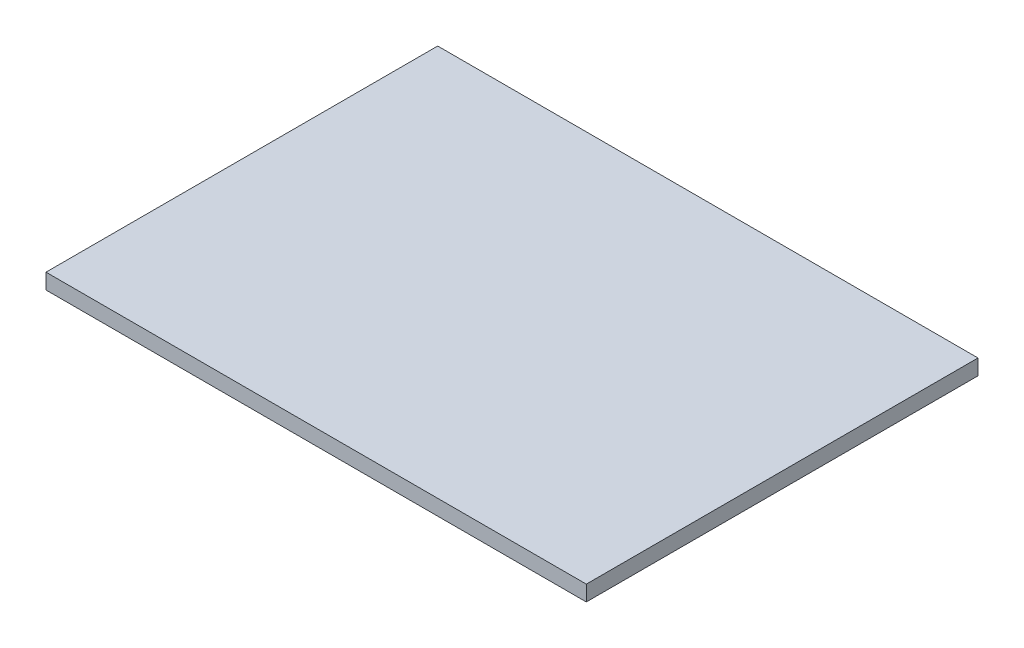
from build123d import *

# Parameters (mm, degrees)
CROQUIS1_W            = 698
CROQUIS1_H            = 20
EXTRUIR1_DEPTH        = 253
CROQUIS2_R            = 17.5
CORTAR_EXTRUIR1_DEPTH = 12


with BuildPart() as part:
    # Croquis1 → Extruir1 (new, symmetric)
    with BuildSketch(Plane.XY):
        Rectangle(CROQUIS1_W, CROQUIS1_H)
    extrude(amount=EXTRUIR1_DEPTH, both=True)

    # Croquis2 → Cortar-Extruir1 (cut)
    with BuildSketch(Plane.XZ.offset(10)):
        with Locations((-250, 231.1)):
            Circle(CROQUIS2_R)
    cortar_extruir1 = extrude(amount=-CORTAR_EXTRUIR1_DEPTH, mode=Mode.SUBTRACT)

    # Simetr_a1: Cortar-Extruir1 across plane
    add(cortar_extruir1.mirror(Plane(origin=(0, 0, 0), x_dir=(0, 0, 1), z_dir=(1, 0, 0))), mode=Mode.SUBTRACT)


solid = part.part
